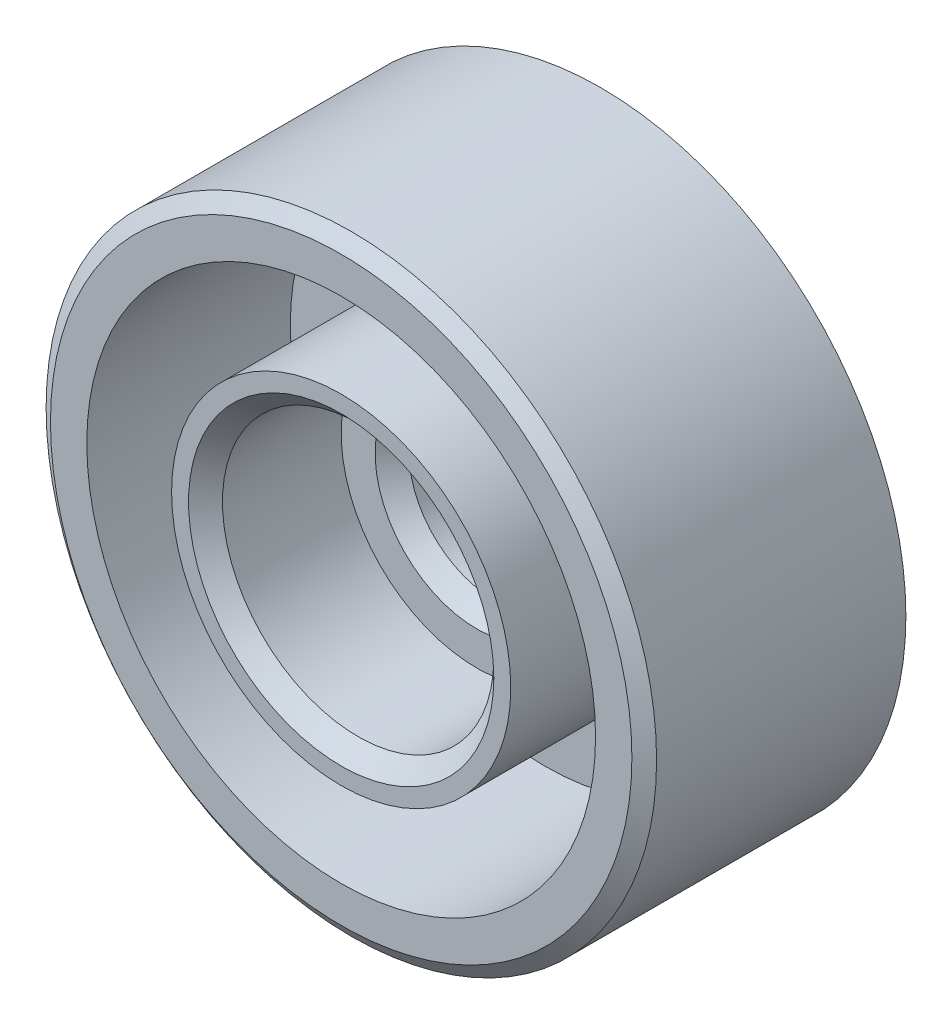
ISO-10303-21;
HEADER;
FILE_DESCRIPTION(('STEP AP214'),'2;1');
FILE_NAME('part.step','',(''),(''),'','','');
FILE_SCHEMA(('AUTOMOTIVE_DESIGN { 1 0 10303 214 1 1 1 1 }'));
ENDSEC;
DATA;
#1=APPLICATION_CONTEXT('core data for automotive mechanical design processes');
#2=APPLICATION_PROTOCOL_DEFINITION('international standard','automotive_design',2000,#1);
#3=PRODUCT_CONTEXT('',#1,'mechanical');
#4=PRODUCT('Part','Part','',(#3));
#5=PRODUCT_RELATED_PRODUCT_CATEGORY('part','',(#4));
#6=PRODUCT_DEFINITION_FORMATION('','',#4);
#7=PRODUCT_DEFINITION_CONTEXT('part definition',#1,'design');
#8=PRODUCT_DEFINITION('design','',#6,#7);
#9=PRODUCT_DEFINITION_SHAPE('','',#8);
#10=(LENGTH_UNIT() NAMED_UNIT(*) SI_UNIT(.MILLI.,.METRE.));
#11=(NAMED_UNIT(*) PLANE_ANGLE_UNIT() SI_UNIT($,.RADIAN.));
#12=(NAMED_UNIT(*) SI_UNIT($,.STERADIAN.) SOLID_ANGLE_UNIT());
#13=UNCERTAINTY_MEASURE_WITH_UNIT(LENGTH_MEASURE(1.E-05),#10,'distance_accuracy_value','');
#14=(GEOMETRIC_REPRESENTATION_CONTEXT(3) GLOBAL_UNCERTAINTY_ASSIGNED_CONTEXT((#13)) GLOBAL_UNIT_ASSIGNED_CONTEXT((#10,
#11,#12)) REPRESENTATION_CONTEXT('',''));
#15=CARTESIAN_POINT('',(0.,0.,0.));
#16=DIRECTION('',(0.,0.,1.));
#17=DIRECTION('',(1.,0.,0.));
#18=AXIS2_PLACEMENT_3D('',#15,#16,#17);
#19=CARTESIAN_POINT('',(0.,0.,8.));
#20=DIRECTION('',(0.,0.,-1.));
#21=DIRECTION('',(-1.,0.,0.));
#22=AXIS2_PLACEMENT_3D('',#19,#20,#21);
#23=CYLINDRICAL_SURFACE('',#22,9.);
#24=CARTESIAN_POINT('',(0.,0.,7.7));
#25=DIRECTION('',(0.,0.,1.));
#26=DIRECTION('',(1.,0.,0.));
#27=AXIS2_PLACEMENT_3D('',#24,#25,#26);
#28=CIRCLE('',#27,9.);
#29=CARTESIAN_POINT('',(9.,0.,7.7));
#30=VERTEX_POINT('',#29);
#31=EDGE_CURVE('E10',#30,#30,#28,.F.);
#32=ORIENTED_EDGE('',*,*,#31,.T.);
#33=EDGE_LOOP('',(#32));
#34=FACE_BOUND('',#33,.T.);
#35=CARTESIAN_POINT('',(0.,0.,0.350103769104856));
#36=DIRECTION('',(0.,0.,1.));
#37=DIRECTION('',(1.,0.,0.));
#38=AXIS2_PLACEMENT_3D('',#35,#36,#37);
#39=CIRCLE('',#38,9.);
#40=CARTESIAN_POINT('',(9.,0.,0.350103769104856));
#41=VERTEX_POINT('',#40);
#42=EDGE_CURVE('E49',#41,#41,#39,.T.);
#43=ORIENTED_EDGE('',*,*,#42,.T.);
#44=EDGE_LOOP('',(#43));
#45=FACE_BOUND('',#44,.T.);
#46=ADVANCED_FACE('F34',(#34,#45),#23,.T.);
#47=CARTESIAN_POINT('',(0.,0.,8.));
#48=DIRECTION('',(0.,0.,1.));
#49=DIRECTION('',(1.,0.,0.));
#50=AXIS2_PLACEMENT_3D('',#47,#48,#49);
#51=PLANE('',#50);
#52=CARTESIAN_POINT('',(0.,0.,8.));
#53=DIRECTION('',(0.,0.,1.));
#54=DIRECTION('',(1.,0.,0.));
#55=AXIS2_PLACEMENT_3D('',#52,#53,#54);
#56=CIRCLE('',#55,8.57155559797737);
#57=CARTESIAN_POINT('',(8.57155559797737,0.,8.));
#58=VERTEX_POINT('',#57);
#59=EDGE_CURVE('E41',#58,#58,#56,.T.);
#60=ORIENTED_EDGE('',*,*,#59,.T.);
#61=EDGE_LOOP('',(#60));
#62=FACE_BOUND('',#61,.T.);
#63=CARTESIAN_POINT('',(0.,0.,8.));
#64=DIRECTION('',(0.,0.,1.));
#65=DIRECTION('',(1.,0.,0.));
#66=AXIS2_PLACEMENT_3D('',#63,#64,#65);
#67=CIRCLE('',#66,7.5);
#68=CARTESIAN_POINT('',(7.5,0.,8.));
#69=VERTEX_POINT('',#68);
#70=EDGE_CURVE('E70',#69,#69,#67,.T.);
#71=ORIENTED_EDGE('',*,*,#70,.F.);
#72=EDGE_LOOP('',(#71));
#73=FACE_BOUND('',#72,.T.);
#74=ADVANCED_FACE('F93',(#62,#73),#51,.T.);
#75=CARTESIAN_POINT('',(0.,0.,0.));
#76=DIRECTION('',(0.,0.,1.));
#77=DIRECTION('',(1.,0.,0.));
#78=AXIS2_PLACEMENT_3D('',#75,#76,#77);
#79=PLANE('',#78);
#80=CARTESIAN_POINT('',(0.,0.,0.));
#81=DIRECTION('',(0.,0.,1.));
#82=DIRECTION('',(1.,0.,0.));
#83=AXIS2_PLACEMENT_3D('',#80,#81,#82);
#84=CIRCLE('',#83,8.49999999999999);
#85=CARTESIAN_POINT('',(8.49999999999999,0.,0.));
#86=VERTEX_POINT('',#85);
#87=EDGE_CURVE('E45',#86,#86,#84,.F.);
#88=ORIENTED_EDGE('',*,*,#87,.T.);
#89=EDGE_LOOP('',(#88));
#90=FACE_BOUND('',#89,.T.);
#91=CARTESIAN_POINT('',(0.,0.,0.));
#92=DIRECTION('',(0.,0.,-1.));
#93=DIRECTION('',(-1.,0.,0.));
#94=AXIS2_PLACEMENT_3D('',#91,#92,#93);
#95=CIRCLE('',#94,3.025);
#96=CARTESIAN_POINT('',(-3.025,0.,0.));
#97=VERTEX_POINT('',#96);
#98=EDGE_CURVE('E84',#97,#97,#95,.T.);
#99=ORIENTED_EDGE('',*,*,#98,.F.);
#100=EDGE_LOOP('',(#99));
#101=FACE_BOUND('',#100,.T.);
#102=ADVANCED_FACE('F90',(#90,#101),#79,.F.);
#103=CARTESIAN_POINT('',(0.,0.,2.));
#104=DIRECTION('',(0.,0.,1.));
#105=DIRECTION('',(1.,0.,0.));
#106=AXIS2_PLACEMENT_3D('',#103,#104,#105);
#107=CYLINDRICAL_SURFACE('',#106,7.5);
#108=CARTESIAN_POINT('',(0.,0.,2.));
#109=DIRECTION('',(0.,0.,1.));
#110=DIRECTION('',(1.,0.,0.));
#111=AXIS2_PLACEMENT_3D('',#108,#109,#110);
#112=CIRCLE('',#111,7.5);
#113=CARTESIAN_POINT('',(7.5,0.,2.));
#114=VERTEX_POINT('',#113);
#115=EDGE_CURVE('E69',#114,#114,#112,.T.);
#116=ORIENTED_EDGE('',*,*,#115,.F.);
#117=EDGE_LOOP('',(#116));
#118=FACE_BOUND('',#117,.T.);
#119=ORIENTED_EDGE('',*,*,#70,.T.);
#120=EDGE_LOOP('',(#119));
#121=FACE_BOUND('',#120,.T.);
#122=ADVANCED_FACE('F92',(#118,#121),#107,.F.);
#123=CARTESIAN_POINT('',(0.,0.,2.));
#124=DIRECTION('',(0.,0.,1.));
#125=DIRECTION('',(1.,0.,0.));
#126=AXIS2_PLACEMENT_3D('',#123,#124,#125);
#127=PLANE('',#126);
#128=CARTESIAN_POINT('',(0.,0.,2.));
#129=DIRECTION('',(0.,0.,1.));
#130=DIRECTION('',(1.,0.,0.));
#131=AXIS2_PLACEMENT_3D('',#128,#129,#130);
#132=CIRCLE('',#131,5.);
#133=CARTESIAN_POINT('',(5.,0.,2.));
#134=VERTEX_POINT('',#133);
#135=EDGE_CURVE('E73',#134,#134,#132,.T.);
#136=ORIENTED_EDGE('',*,*,#135,.F.);
#137=EDGE_LOOP('',(#136));
#138=FACE_BOUND('',#137,.T.);
#139=ORIENTED_EDGE('',*,*,#115,.T.);
#140=EDGE_LOOP('',(#139));
#141=FACE_BOUND('',#140,.T.);
#142=ADVANCED_FACE('F100',(#138,#141),#127,.T.);
#143=CARTESIAN_POINT('',(0.,0.,2.));
#144=DIRECTION('',(0.,0.,1.));
#145=DIRECTION('',(1.,0.,0.));
#146=AXIS2_PLACEMENT_3D('',#143,#144,#145);
#147=CYLINDRICAL_SURFACE('',#146,5.);
#148=ORIENTED_EDGE('',*,*,#135,.T.);
#149=EDGE_LOOP('',(#148));
#150=FACE_BOUND('',#149,.T.);
#151=CARTESIAN_POINT('',(0.,0.,8.));
#152=DIRECTION('',(0.,0.,1.));
#153=DIRECTION('',(1.,0.,0.));
#154=AXIS2_PLACEMENT_3D('',#151,#152,#153);
#155=CIRCLE('',#154,5.);
#156=CARTESIAN_POINT('',(5.,0.,8.));
#157=VERTEX_POINT('',#156);
#158=EDGE_CURVE('E76',#157,#157,#155,.T.);
#159=ORIENTED_EDGE('',*,*,#158,.F.);
#160=EDGE_LOOP('',(#159));
#161=FACE_BOUND('',#160,.T.);
#162=ADVANCED_FACE('F206',(#150,#161),#147,.T.);
#163=CARTESIAN_POINT('',(0.,0.,4.));
#164=DIRECTION('',(0.,0.,1.));
#165=DIRECTION('',(1.,0.,0.));
#166=AXIS2_PLACEMENT_3D('',#163,#164,#165);
#167=PLANE('',#166);
#168=CARTESIAN_POINT('',(0.,0.,4.));
#169=DIRECTION('',(0.,0.,1.));
#170=DIRECTION('',(1.,0.,0.));
#171=AXIS2_PLACEMENT_3D('',#168,#169,#170);
#172=CIRCLE('',#171,3.);
#173=CARTESIAN_POINT('',(3.,0.,4.));
#174=VERTEX_POINT('',#173);
#175=EDGE_CURVE('E60',#174,#174,#172,.F.);
#176=ORIENTED_EDGE('',*,*,#175,.T.);
#177=EDGE_LOOP('',(#176));
#178=FACE_BOUND('',#177,.T.);
#179=CARTESIAN_POINT('',(0.,0.,4.));
#180=DIRECTION('',(0.,0.,1.));
#181=DIRECTION('',(1.,0.,0.));
#182=AXIS2_PLACEMENT_3D('',#179,#180,#181);
#183=CIRCLE('',#182,4.);
#184=CARTESIAN_POINT('',(4.,0.,4.));
#185=VERTEX_POINT('',#184);
#186=EDGE_CURVE('E66',#185,#185,#183,.T.);
#187=ORIENTED_EDGE('',*,*,#186,.T.);
#188=EDGE_LOOP('',(#187));
#189=FACE_BOUND('',#188,.T.);
#190=ADVANCED_FACE('F197',(#178,#189),#167,.T.);
#191=CARTESIAN_POINT('',(0.,0.,4.));
#192=DIRECTION('',(0.,0.,1.));
#193=DIRECTION('',(1.,0.,0.));
#194=AXIS2_PLACEMENT_3D('',#191,#192,#193);
#195=CYLINDRICAL_SURFACE('',#194,4.);
#196=CARTESIAN_POINT('',(0.,0.,7.5));
#197=DIRECTION('',(0.,0.,1.));
#198=DIRECTION('',(1.,0.,0.));
#199=AXIS2_PLACEMENT_3D('',#196,#197,#198);
#200=CIRCLE('',#199,4.);
#201=CARTESIAN_POINT('',(4.,0.,7.5));
#202=VERTEX_POINT('',#201);
#203=EDGE_CURVE('E57',#202,#202,#200,.T.);
#204=ORIENTED_EDGE('',*,*,#203,.T.);
#205=EDGE_LOOP('',(#204));
#206=FACE_BOUND('',#205,.T.);
#207=ORIENTED_EDGE('',*,*,#186,.F.);
#208=EDGE_LOOP('',(#207));
#209=FACE_BOUND('',#208,.T.);
#210=ADVANCED_FACE('F187',(#206,#209),#195,.F.);
#211=CARTESIAN_POINT('',(0.,0.,8.));
#212=DIRECTION('',(0.,0.,1.));
#213=DIRECTION('',(1.,0.,0.));
#214=AXIS2_PLACEMENT_3D('',#211,#212,#213);
#215=CIRCLE('',#214,4.5);
#216=CARTESIAN_POINT('',(4.5,0.,8.));
#217=VERTEX_POINT('',#216);
#218=EDGE_CURVE('E54',#217,#217,#215,.F.);
#219=ORIENTED_EDGE('',*,*,#218,.T.);
#220=EDGE_LOOP('',(#219));
#221=FACE_BOUND('',#220,.T.);
#222=ORIENTED_EDGE('',*,*,#158,.T.);
#223=EDGE_LOOP('',(#222));
#224=FACE_BOUND('',#223,.T.);
#225=ADVANCED_FACE('F104',(#221,#224),#51,.T.);
#226=CARTESIAN_POINT('',(0.,0.,0.));
#227=DIRECTION('',(0.,0.,-1.));
#228=DIRECTION('',(-1.,0.,0.));
#229=AXIS2_PLACEMENT_3D('',#226,#227,#228);
#230=CYLINDRICAL_SURFACE('',#229,2.49999999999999);
#231=CARTESIAN_POINT('',(0.,0.,3.5));
#232=DIRECTION('',(0.,0.,1.));
#233=DIRECTION('',(1.,0.,0.));
#234=AXIS2_PLACEMENT_3D('',#231,#232,#233);
#235=CIRCLE('',#234,2.49999999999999);
#236=CARTESIAN_POINT('',(2.49999999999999,0.,3.5));
#237=VERTEX_POINT('',#236);
#238=EDGE_CURVE('E63',#237,#237,#235,.T.);
#239=ORIENTED_EDGE('',*,*,#238,.T.);
#240=EDGE_LOOP('',(#239));
#241=FACE_BOUND('',#240,.T.);
#242=CARTESIAN_POINT('',(0.,0.,0.525000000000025));
#243=DIRECTION('',(0.,0.,-1.));
#244=DIRECTION('',(-1.,0.,0.));
#245=AXIS2_PLACEMENT_3D('',#242,#243,#244);
#246=CIRCLE('',#245,2.49999999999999);
#247=CARTESIAN_POINT('',(-2.49999999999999,0.,0.525000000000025));
#248=VERTEX_POINT('',#247);
#249=EDGE_CURVE('E79',#248,#248,#246,.T.);
#250=ORIENTED_EDGE('',*,*,#249,.T.);
#251=EDGE_LOOP('',(#250));
#252=FACE_BOUND('',#251,.T.);
#253=ADVANCED_FACE('F172',(#241,#252),#230,.F.);
#254=CARTESIAN_POINT('',(0.,0.,0.));
#255=DIRECTION('',(0.,0.,-1.));
#256=DIRECTION('',(-1.,0.,0.));
#257=AXIS2_PLACEMENT_3D('',#254,#255,#256);
#258=CONICAL_SURFACE('',#257,3.025,0.785398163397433);
#259=ORIENTED_EDGE('',*,*,#249,.F.);
#260=EDGE_LOOP('',(#259));
#261=FACE_BOUND('',#260,.T.);
#262=ORIENTED_EDGE('',*,*,#98,.T.);
#263=EDGE_LOOP('',(#262));
#264=FACE_BOUND('',#263,.T.);
#265=ADVANCED_FACE('F88',(#261,#264),#258,.F.);
#266=CARTESIAN_POINT('',(0.,0.,3.5));
#267=DIRECTION('',(0.,0.,1.));
#268=DIRECTION('',(1.,0.,0.));
#269=AXIS2_PLACEMENT_3D('',#266,#267,#268);
#270=CONICAL_SURFACE('',#269,2.49999999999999,0.78539816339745);
#271=ORIENTED_EDGE('',*,*,#175,.F.);
#272=EDGE_LOOP('',(#271));
#273=FACE_BOUND('',#272,.T.);
#274=ORIENTED_EDGE('',*,*,#238,.F.);
#275=EDGE_LOOP('',(#274));
#276=FACE_BOUND('',#275,.T.);
#277=ADVANCED_FACE('F111',(#273,#276),#270,.F.);
#278=CARTESIAN_POINT('',(0.,0.,7.5));
#279=DIRECTION('',(0.,0.,1.));
#280=DIRECTION('',(1.,0.,0.));
#281=AXIS2_PLACEMENT_3D('',#278,#279,#280);
#282=CONICAL_SURFACE('',#281,4.,0.785398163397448);
#283=ORIENTED_EDGE('',*,*,#218,.F.);
#284=EDGE_LOOP('',(#283));
#285=FACE_BOUND('',#284,.T.);
#286=ORIENTED_EDGE('',*,*,#203,.F.);
#287=EDGE_LOOP('',(#286));
#288=FACE_BOUND('',#287,.T.);
#289=ADVANCED_FACE('F114',(#285,#288),#282,.F.);
#290=CARTESIAN_POINT('',(0.,0.,0.350103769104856));
#291=DIRECTION('',(0.,0.,1.));
#292=DIRECTION('',(1.,0.,0.));
#293=AXIS2_PLACEMENT_3D('',#290,#291,#292);
#294=CONICAL_SURFACE('',#293,9.,0.959931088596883);
#295=CARTESIAN_POINT('',(8.49999999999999,0.,0.));
#296=CARTESIAN_POINT('',(8.50520833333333,0.,0.00364691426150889));
#297=CARTESIAN_POINT('',(8.51041666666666,0.,0.00729382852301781));
#298=CARTESIAN_POINT('',(8.52083333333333,0.,0.0145876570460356));
#299=CARTESIAN_POINT('',(8.52604166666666,0.,0.0182345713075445));
#300=CARTESIAN_POINT('',(8.53645833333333,0.,0.0255283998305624));
#301=CARTESIAN_POINT('',(8.54166666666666,0.,0.0291753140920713));
#302=CARTESIAN_POINT('',(8.55208333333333,0.,0.0364691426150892));
#303=CARTESIAN_POINT('',(8.55729166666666,0.,0.0401160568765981));
#304=CARTESIAN_POINT('',(8.56770833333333,0.,0.0474098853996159));
#305=CARTESIAN_POINT('',(8.57291666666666,0.,0.0510567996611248));
#306=CARTESIAN_POINT('',(8.58333333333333,0.,0.0583506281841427));
#307=CARTESIAN_POINT('',(8.58854166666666,0.,0.0619975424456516));
#308=CARTESIAN_POINT('',(8.59895833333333,0.,0.0692913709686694));
#309=CARTESIAN_POINT('',(8.60416666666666,0.,0.0729382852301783));
#310=CARTESIAN_POINT('',(8.61458333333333,0.,0.0802321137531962));
#311=CARTESIAN_POINT('',(8.61979166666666,0.,0.0838790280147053));
#312=CARTESIAN_POINT('',(8.63020833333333,0.,0.091172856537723));
#313=CARTESIAN_POINT('',(8.63541666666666,0.,0.0948197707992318));
#314=CARTESIAN_POINT('',(8.64583333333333,0.,0.10211359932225));
#315=CARTESIAN_POINT('',(8.65104166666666,0.,0.105760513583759));
#316=CARTESIAN_POINT('',(8.66145833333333,0.,0.113054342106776));
#317=CARTESIAN_POINT('',(8.66666666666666,0.,0.116701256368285));
#318=CARTESIAN_POINT('',(8.67708333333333,0.,0.123995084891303));
#319=CARTESIAN_POINT('',(8.68229166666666,0.,0.127641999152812));
#320=CARTESIAN_POINT('',(8.69270833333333,0.,0.13493582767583));
#321=CARTESIAN_POINT('',(8.69791666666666,0.,0.138582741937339));
#322=CARTESIAN_POINT('',(8.70833333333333,0.,0.145876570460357));
#323=CARTESIAN_POINT('',(8.71354166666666,0.,0.149523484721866));
#324=CARTESIAN_POINT('',(8.72395833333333,0.,0.156817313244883));
#325=CARTESIAN_POINT('',(8.72916666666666,0.,0.160464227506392));
#326=CARTESIAN_POINT('',(8.73958333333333,0.,0.16775805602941));
#327=CARTESIAN_POINT('',(8.74479166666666,0.,0.171404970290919));
#328=CARTESIAN_POINT('',(8.75520833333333,0.,0.178698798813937));
#329=CARTESIAN_POINT('',(8.76041666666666,0.,0.182345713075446));
#330=CARTESIAN_POINT('',(8.77083333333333,0.,0.189639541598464));
#331=CARTESIAN_POINT('',(8.77604166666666,0.,0.193286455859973));
#332=CARTESIAN_POINT('',(8.78645833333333,0.,0.20058028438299));
#333=CARTESIAN_POINT('',(8.79166666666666,0.,0.204227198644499));
#334=CARTESIAN_POINT('',(8.80208333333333,0.,0.211521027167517));
#335=CARTESIAN_POINT('',(8.80729166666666,0.,0.215167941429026));
#336=CARTESIAN_POINT('',(8.81770833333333,0.,0.222461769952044));
#337=CARTESIAN_POINT('',(8.82291666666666,0.,0.226108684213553));
#338=CARTESIAN_POINT('',(8.83333333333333,0.,0.233402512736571));
#339=CARTESIAN_POINT('',(8.83854166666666,0.,0.23704942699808));
#340=CARTESIAN_POINT('',(8.84895833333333,0.,0.244343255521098));
#341=CARTESIAN_POINT('',(8.85416666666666,0.,0.247990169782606));
#342=CARTESIAN_POINT('',(8.86458333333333,0.,0.255283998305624));
#343=CARTESIAN_POINT('',(8.86979166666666,0.,0.258930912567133));
#344=CARTESIAN_POINT('',(8.88020833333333,0.,0.266224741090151));
#345=CARTESIAN_POINT('',(8.88541666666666,0.,0.26987165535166));
#346=CARTESIAN_POINT('',(8.89583333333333,0.,0.277165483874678));
#347=CARTESIAN_POINT('',(8.90104166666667,0.,0.280812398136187));
#348=CARTESIAN_POINT('',(8.91145833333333,0.,0.288106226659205));
#349=CARTESIAN_POINT('',(8.91666666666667,0.,0.291753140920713));
#350=CARTESIAN_POINT('',(8.92708333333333,0.,0.299046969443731));
#351=CARTESIAN_POINT('',(8.93229166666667,0.,0.30269388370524));
#352=CARTESIAN_POINT('',(8.94270833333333,0.,0.309987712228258));
#353=CARTESIAN_POINT('',(8.94791666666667,0.,0.313634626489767));
#354=CARTESIAN_POINT('',(8.95833333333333,0.,0.320928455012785));
#355=CARTESIAN_POINT('',(8.96354166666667,0.,0.324575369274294));
#356=CARTESIAN_POINT('',(8.97395833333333,0.,0.331869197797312));
#357=CARTESIAN_POINT('',(8.97916666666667,0.,0.33551611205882));
#358=CARTESIAN_POINT('',(8.98958333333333,0.,0.342809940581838));
#359=CARTESIAN_POINT('',(8.99479166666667,0.,0.346456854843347));
#360=CARTESIAN_POINT('',(9.,0.,0.350103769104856));
#361=B_SPLINE_CURVE_WITH_KNOTS('',3,(#295,#296,#297,#298,#299,#300,#301,#302,#303,#304,#305,
#306,#307,#308,#309,#310,#311,#312,#313,#314,#315,#316,#317,#318,#319,#320,#321,#322,#323,#324,
#325,#326,#327,#328,#329,#330,#331,#332,#333,#334,#335,#336,#337,#338,#339,#340,#341,#342,#343,
#344,#345,#346,#347,#348,#349,#350,#351,#352,#353,#354,#355,#356,#357,#358,#359,#360),
.UNSPECIFIED.,.F.,.F.,(4,2,2,2,2,2,2,2,2,2,2,2,2,2,2,2,2,2,2,2,2,2,2,2,2,2,2,2,2,2,2,2,4),(0.,
0.0190746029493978,0.0381492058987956,0.0572238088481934,0.0762984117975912,0.0953730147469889,
0.114447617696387,0.133522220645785,0.152596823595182,0.171671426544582,0.190746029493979,
0.209820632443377,0.228895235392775,0.247969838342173,0.26704444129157,0.286119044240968,
0.305193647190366,0.324268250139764,0.343342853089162,0.362417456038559,0.381492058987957,
0.400566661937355,0.419641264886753,0.43871586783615,0.457790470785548,0.476865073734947,
0.495939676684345,0.515014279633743,0.534088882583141,0.553163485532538,0.572238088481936,
0.591312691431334,0.610387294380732),.UNSPECIFIED.);
#362=EDGE_CURVE('BSEAM117',#86,#41,#361,.T.);
#363=ORIENTED_EDGE('',*,*,#87,.F.);
#364=ORIENTED_EDGE('',*,*,#42,.F.);
#365=ORIENTED_EDGE('',*,*,#362,.T.);
#366=ORIENTED_EDGE('',*,*,#362,.F.);
#367=EDGE_LOOP('',(#363,#365,#364,#366));
#368=FACE_BOUND('',#367,.T.);
#369=ADVANCED_FACE('F117',(#368),#294,.T.);
#370=CARTESIAN_POINT('',(0.,0.,8.));
#371=DIRECTION('',(0.,0.,-1.));
#372=DIRECTION('',(-1.,0.,0.));
#373=AXIS2_PLACEMENT_3D('',#370,#371,#372);
#374=CONICAL_SURFACE('',#373,8.57155559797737,0.959931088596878);
#375=ORIENTED_EDGE('',*,*,#31,.F.);
#376=EDGE_LOOP('',(#375));
#377=FACE_BOUND('',#376,.T.);
#378=ORIENTED_EDGE('',*,*,#59,.F.);
#379=EDGE_LOOP('',(#378));
#380=FACE_BOUND('',#379,.T.);
#381=ADVANCED_FACE('F36',(#377,#380),#374,.T.);
#382=CLOSED_SHELL('',(#46,#74,#102,#122,#142,#162,#190,#210,#225,#253,#265,#277,#289,#369,#381));
#383=MANIFOLD_SOLID_BREP('B2',#382);
#384=ADVANCED_BREP_SHAPE_REPRESENTATION('',(#18,#383),#14);
#385=SHAPE_DEFINITION_REPRESENTATION(#9,#384);
ENDSEC;
END-ISO-10303-21;
